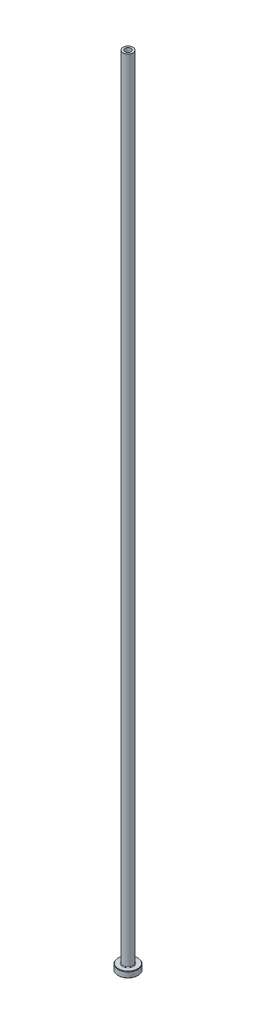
from build123d import *

# Parameters (mm, degrees)
FILLET1_R     = 0.3
CHAMFER1_SIZE = 0.2
CHAMFER3_SIZE = 0.5


with BuildPart() as part:
    # Sketch1 → Revolve1 (revolve)
    with BuildSketch(Plane.XY, mode=Mode.PRIVATE) as revolve1_sk:
        Polygon((-1.5, 400), (-2.5, 400), (-2.5, 3), (-5, 3), (-5, 0), (-1.75, 0), (-1.75, 343), (-1.5, 355), align=None)
    revolve(revolve1_sk.sketch.rotate(Axis((0, 92.187680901, 0), (0, -1, 0)), 270), axis=Axis((0, 92.187680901, 0), (0, -1, 0)))

    # Fillet1
    fillet1_edges = [part.edges().sort_by_distance(p)[0] for p in [
        (0, 3, -2.5),
    ]]
    fillet(fillet1_edges, radius=FILLET1_R)

    # Chamfer1
    chamfer1_edges = [part.edges().sort_by_distance(p)[0] for p in [
        (0, 0, -5),
        (0, 3, -5),
    ]]
    chamfer(chamfer1_edges, length=CHAMFER1_SIZE)

    # Chamfer3
    chamfer3_edges = [part.edges().sort_by_distance(p)[0] for p in [
        (0, 0, -1.75),
    ]]
    chamfer(chamfer3_edges, length=CHAMFER3_SIZE)


solid = part.part
